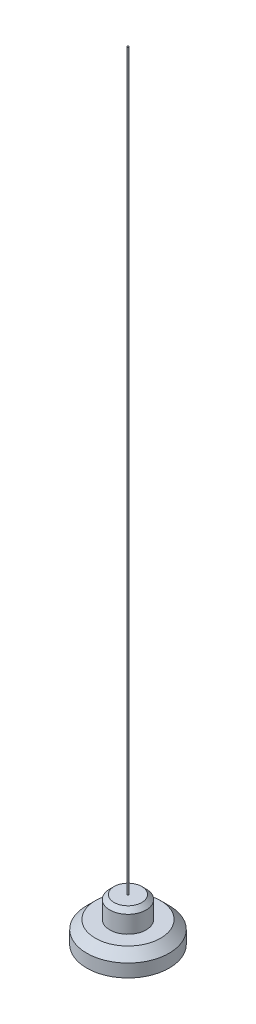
from build123d import *

# Parameters (mm, degrees)
SKETCH1_R      = 24.257
EXTRUDE1_DEPTH = 12.7
CHAMFER1_SIZE  = 5.08
SKETCH2_R      = 10.691922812
EXTRUDE2_DEPTH = 12.7
CHAMFER2_SIZE  = 2.54
SKETCH3_R      = 0.508
EXTRUDE3_DEPTH = 431.8


with BuildPart() as part:
    # Sketch1 → Extrude1 (new body)
    with BuildSketch(Plane(origin=(0, 0, 0), x_dir=(1, 0, 0), z_dir=(0, 1, 0))):
        with Locations(Location((0, 0, 0), (0, 0, 270))):
            Circle(SKETCH1_R)
    extrude(amount=EXTRUDE1_DEPTH)

    # Chamfer1
    chamfer1_edges = [part.edges().sort_by_distance(p)[0] for p in [
        (0, 12.7, -24.257),
    ]]
    chamfer(chamfer1_edges, length=CHAMFER1_SIZE)


with BuildPart() as body_2:
    # Sketch2 → Extrude2 (new body)
    with BuildSketch(Plane(origin=(0, 12.7, 0), x_dir=(-1, 0, 0), z_dir=(0, 1, 0))):
        with Locations(Location((0, 0, 0), (0, 0, 90))):
            Circle(SKETCH2_R)
    extrude(amount=EXTRUDE2_DEPTH)

    # Chamfer2
    chamfer2_edges = [body_2.edges().sort_by_distance(p)[0] for p in [
        (0, 25.4, -10.691922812),
    ]]
    chamfer(chamfer2_edges, length=CHAMFER2_SIZE)

    # Sketch3 → Extrude3 (add)
    with BuildSketch(Plane(origin=(0, 25.4, 0), x_dir=(-1, 0, 0), z_dir=(0, 1, 0))):
        with Locations(Location((0, 0, 0), (0, 0, 90))):
            Circle(SKETCH3_R)
    extrude(amount=EXTRUDE3_DEPTH)


solid = Compound([part.part, body_2.part])
